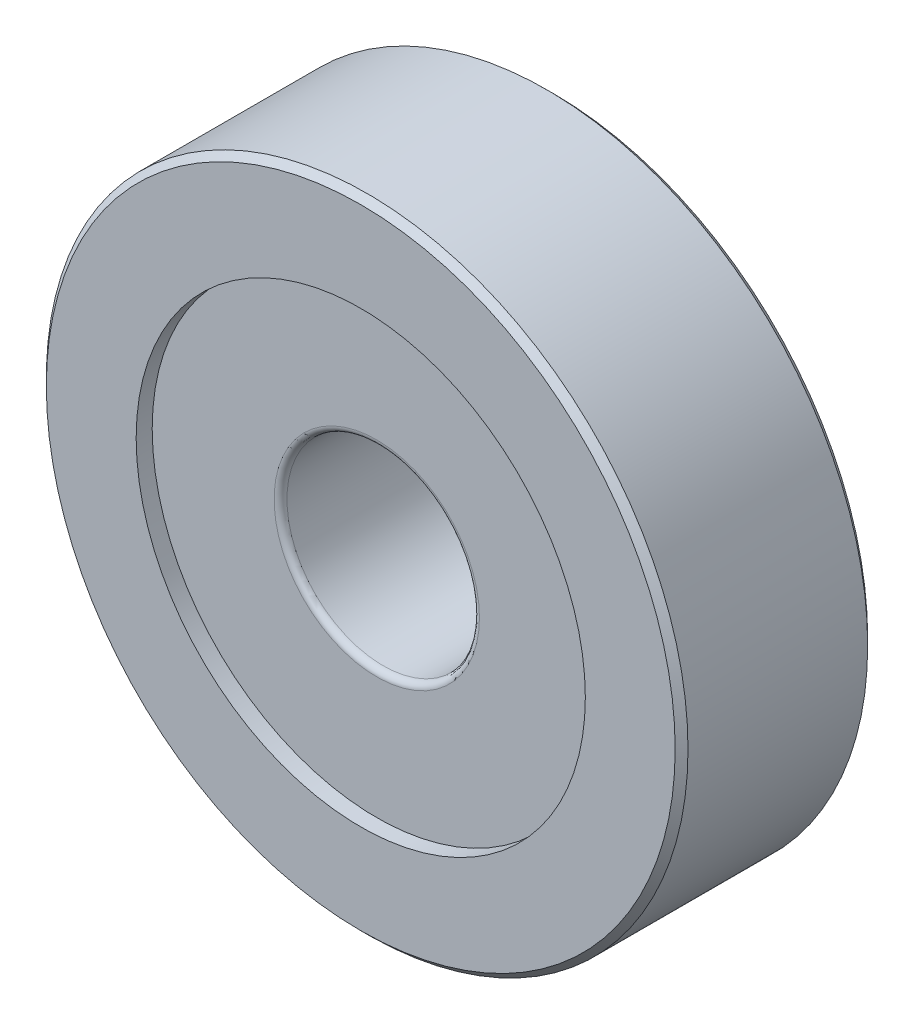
ISO-10303-21;
HEADER;
FILE_DESCRIPTION(('STEP AP214'),'2;1');
FILE_NAME('part.step','',(''),(''),'','','');
FILE_SCHEMA(('AUTOMOTIVE_DESIGN { 1 0 10303 214 1 1 1 1 }'));
ENDSEC;
DATA;
#1=APPLICATION_CONTEXT('core data for automotive mechanical design processes');
#2=APPLICATION_PROTOCOL_DEFINITION('international standard','automotive_design',2000,#1);
#3=PRODUCT_CONTEXT('',#1,'mechanical');
#4=PRODUCT('Part','Part','',(#3));
#5=PRODUCT_RELATED_PRODUCT_CATEGORY('part','',(#4));
#6=PRODUCT_DEFINITION_FORMATION('','',#4);
#7=PRODUCT_DEFINITION_CONTEXT('part definition',#1,'design');
#8=PRODUCT_DEFINITION('design','',#6,#7);
#9=PRODUCT_DEFINITION_SHAPE('','',#8);
#10=(LENGTH_UNIT() NAMED_UNIT(*) SI_UNIT(.MILLI.,.METRE.));
#11=(NAMED_UNIT(*) PLANE_ANGLE_UNIT() SI_UNIT($,.RADIAN.));
#12=(NAMED_UNIT(*) SI_UNIT($,.STERADIAN.) SOLID_ANGLE_UNIT());
#13=UNCERTAINTY_MEASURE_WITH_UNIT(LENGTH_MEASURE(1.E-05),#10,'distance_accuracy_value','');
#14=(GEOMETRIC_REPRESENTATION_CONTEXT(3) GLOBAL_UNCERTAINTY_ASSIGNED_CONTEXT((#13)) GLOBAL_UNIT_ASSIGNED_CONTEXT((#10,
#11,#12)) REPRESENTATION_CONTEXT('',''));
#15=CARTESIAN_POINT('',(0.,0.,0.));
#16=DIRECTION('',(0.,0.,1.));
#17=DIRECTION('',(1.,0.,0.));
#18=AXIS2_PLACEMENT_3D('',#15,#16,#17);
#19=CARTESIAN_POINT('',(0.,0.,2.30000000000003));
#20=DIRECTION('',(0.,0.,1.));
#21=DIRECTION('',(1.,0.,0.));
#22=AXIS2_PLACEMENT_3D('',#19,#20,#21);
#23=TOROIDAL_SURFACE('',#22,3.2,0.199999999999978);
#24=CARTESIAN_POINT('',(0.,0.,2.30000000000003));
#25=DIRECTION('',(0.,0.,1.));
#26=DIRECTION('',(1.,0.,0.));
#27=AXIS2_PLACEMENT_3D('',#24,#25,#26);
#28=CIRCLE('',#27,3.);
#29=CARTESIAN_POINT('',(3.,0.,2.30000000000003));
#30=VERTEX_POINT('',#29);
#31=EDGE_CURVE('E8',#30,#30,#28,.T.);
#32=ORIENTED_EDGE('',*,*,#31,.F.);
#33=EDGE_LOOP('',(#32));
#34=FACE_BOUND('',#33,.T.);
#35=CARTESIAN_POINT('',(0.,0.,2.5));
#36=DIRECTION('',(0.,0.,1.));
#37=DIRECTION('',(1.,0.,0.));
#38=AXIS2_PLACEMENT_3D('',#35,#36,#37);
#39=CIRCLE('',#38,3.2);
#40=CARTESIAN_POINT('',(3.2,0.,2.5));
#41=VERTEX_POINT('',#40);
#42=EDGE_CURVE('E52',#41,#41,#39,.T.);
#43=ORIENTED_EDGE('',*,*,#42,.T.);
#44=EDGE_LOOP('',(#43));
#45=FACE_BOUND('',#44,.T.);
#46=ADVANCED_FACE('F12',(#34,#45),#23,.T.);
#47=CARTESIAN_POINT('',(0.,0.,6.));
#48=DIRECTION('',(0.,0.,1.));
#49=DIRECTION('',(1.,0.,0.));
#50=AXIS2_PLACEMENT_3D('',#47,#48,#49);
#51=CYLINDRICAL_SURFACE('',#50,3.);
#52=CARTESIAN_POINT('',(0.,0.,-2.3));
#53=DIRECTION('',(0.,0.,1.));
#54=DIRECTION('',(1.,0.,0.));
#55=AXIS2_PLACEMENT_3D('',#52,#53,#54);
#56=CIRCLE('',#55,3.);
#57=CARTESIAN_POINT('',(3.,0.,-2.3));
#58=VERTEX_POINT('',#57);
#59=EDGE_CURVE('E18',#58,#58,#56,.T.);
#60=ORIENTED_EDGE('',*,*,#59,.F.);
#61=EDGE_LOOP('',(#60));
#62=FACE_BOUND('',#61,.T.);
#63=ORIENTED_EDGE('',*,*,#31,.T.);
#64=EDGE_LOOP('',(#63));
#65=FACE_BOUND('',#64,.T.);
#66=ADVANCED_FACE('F113',(#62,#65),#51,.F.);
#67=CARTESIAN_POINT('',(0.,0.,-2.3));
#68=DIRECTION('',(0.,0.,1.));
#69=DIRECTION('',(1.,0.,0.));
#70=AXIS2_PLACEMENT_3D('',#67,#68,#69);
#71=TOROIDAL_SURFACE('',#70,3.2,0.199999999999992);
#72=CARTESIAN_POINT('',(0.,0.,-2.5));
#73=DIRECTION('',(0.,0.,1.));
#74=DIRECTION('',(1.,0.,0.));
#75=AXIS2_PLACEMENT_3D('',#72,#73,#74);
#76=CIRCLE('',#75,3.2);
#77=CARTESIAN_POINT('',(3.2,0.,-2.5));
#78=VERTEX_POINT('',#77);
#79=EDGE_CURVE('E22',#78,#78,#76,.T.);
#80=ORIENTED_EDGE('',*,*,#79,.F.);
#81=EDGE_LOOP('',(#80));
#82=FACE_BOUND('',#81,.T.);
#83=ORIENTED_EDGE('',*,*,#59,.T.);
#84=EDGE_LOOP('',(#83));
#85=FACE_BOUND('',#84,.T.);
#86=ADVANCED_FACE('F108',(#82,#85),#71,.T.);
#87=CARTESIAN_POINT('',(0.,3.2,-2.5));
#88=DIRECTION('',(0.,0.,1.));
#89=DIRECTION('',(1.,0.,0.));
#90=AXIS2_PLACEMENT_3D('',#87,#88,#89);
#91=PLANE('',#90);
#92=CARTESIAN_POINT('',(0.,0.,-2.5));
#93=DIRECTION('',(0.,0.,1.));
#94=DIRECTION('',(1.,0.,0.));
#95=AXIS2_PLACEMENT_3D('',#92,#93,#94);
#96=CIRCLE('',#95,7.);
#97=CARTESIAN_POINT('',(7.,0.,-2.5));
#98=VERTEX_POINT('',#97);
#99=EDGE_CURVE('E26',#98,#98,#96,.T.);
#100=ORIENTED_EDGE('',*,*,#99,.F.);
#101=EDGE_LOOP('',(#100));
#102=FACE_BOUND('',#101,.T.);
#103=ORIENTED_EDGE('',*,*,#79,.T.);
#104=EDGE_LOOP('',(#103));
#105=FACE_BOUND('',#104,.T.);
#106=ADVANCED_FACE('F102',(#102,#105),#91,.F.);
#107=CARTESIAN_POINT('',(0.,0.,6.));
#108=DIRECTION('',(0.,0.,1.));
#109=DIRECTION('',(1.,0.,0.));
#110=AXIS2_PLACEMENT_3D('',#107,#108,#109);
#111=CYLINDRICAL_SURFACE('',#110,7.);
#112=CARTESIAN_POINT('',(0.,0.,-3.));
#113=DIRECTION('',(0.,0.,1.));
#114=DIRECTION('',(1.,0.,0.));
#115=AXIS2_PLACEMENT_3D('',#112,#113,#114);
#116=CIRCLE('',#115,7.);
#117=CARTESIAN_POINT('',(7.,0.,-3.));
#118=VERTEX_POINT('',#117);
#119=EDGE_CURVE('E31',#118,#118,#116,.T.);
#120=ORIENTED_EDGE('',*,*,#119,.F.);
#121=EDGE_LOOP('',(#120));
#122=FACE_BOUND('',#121,.T.);
#123=ORIENTED_EDGE('',*,*,#99,.T.);
#124=EDGE_LOOP('',(#123));
#125=FACE_BOUND('',#124,.T.);
#126=ADVANCED_FACE('F96',(#122,#125),#111,.F.);
#127=CARTESIAN_POINT('',(0.,9.8,-3.));
#128=DIRECTION('',(0.,0.,1.));
#129=DIRECTION('',(1.,0.,0.));
#130=AXIS2_PLACEMENT_3D('',#127,#128,#129);
#131=PLANE('',#130);
#132=CARTESIAN_POINT('',(0.,0.,-3.));
#133=DIRECTION('',(0.,0.,1.));
#134=DIRECTION('',(1.,0.,0.));
#135=AXIS2_PLACEMENT_3D('',#132,#133,#134);
#136=CIRCLE('',#135,9.8);
#137=CARTESIAN_POINT('',(9.8,0.,-3.));
#138=VERTEX_POINT('',#137);
#139=EDGE_CURVE('E34',#138,#138,#136,.T.);
#140=ORIENTED_EDGE('',*,*,#139,.F.);
#141=EDGE_LOOP('',(#140));
#142=FACE_BOUND('',#141,.T.);
#143=ORIENTED_EDGE('',*,*,#119,.T.);
#144=EDGE_LOOP('',(#143));
#145=FACE_BOUND('',#144,.T.);
#146=ADVANCED_FACE('F90',(#142,#145),#131,.F.);
#147=CARTESIAN_POINT('',(0.,0.,-3.));
#148=DIRECTION('',(0.,0.,1.));
#149=DIRECTION('',(1.,0.,0.));
#150=AXIS2_PLACEMENT_3D('',#147,#148,#149);
#151=CONICAL_SURFACE('',#150,9.8,0.785398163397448);
#152=CARTESIAN_POINT('',(0.,0.,-2.8));
#153=DIRECTION('',(0.,0.,1.));
#154=DIRECTION('',(1.,0.,0.));
#155=AXIS2_PLACEMENT_3D('',#152,#153,#154);
#156=CIRCLE('',#155,10.);
#157=CARTESIAN_POINT('',(10.,0.,-2.8));
#158=VERTEX_POINT('',#157);
#159=EDGE_CURVE('E37',#158,#158,#156,.T.);
#160=ORIENTED_EDGE('',*,*,#159,.F.);
#161=EDGE_LOOP('',(#160));
#162=FACE_BOUND('',#161,.T.);
#163=ORIENTED_EDGE('',*,*,#139,.T.);
#164=EDGE_LOOP('',(#163));
#165=FACE_BOUND('',#164,.T.);
#166=ADVANCED_FACE('F84',(#162,#165),#151,.T.);
#167=CARTESIAN_POINT('',(0.,0.,6.));
#168=DIRECTION('',(0.,0.,1.));
#169=DIRECTION('',(1.,0.,0.));
#170=AXIS2_PLACEMENT_3D('',#167,#168,#169);
#171=CYLINDRICAL_SURFACE('',#170,10.);
#172=CARTESIAN_POINT('',(0.,0.,2.8));
#173=DIRECTION('',(0.,0.,1.));
#174=DIRECTION('',(1.,0.,0.));
#175=AXIS2_PLACEMENT_3D('',#172,#173,#174);
#176=CIRCLE('',#175,10.);
#177=CARTESIAN_POINT('',(10.,0.,2.8));
#178=VERTEX_POINT('',#177);
#179=EDGE_CURVE('E40',#178,#178,#176,.T.);
#180=ORIENTED_EDGE('',*,*,#179,.F.);
#181=EDGE_LOOP('',(#180));
#182=FACE_BOUND('',#181,.T.);
#183=ORIENTED_EDGE('',*,*,#159,.T.);
#184=EDGE_LOOP('',(#183));
#185=FACE_BOUND('',#184,.T.);
#186=ADVANCED_FACE('F78',(#182,#185),#171,.T.);
#187=CARTESIAN_POINT('',(0.,0.,2.8));
#188=DIRECTION('',(0.,0.,-1.));
#189=DIRECTION('',(-1.,0.,0.));
#190=AXIS2_PLACEMENT_3D('',#187,#188,#189);
#191=CONICAL_SURFACE('',#190,10.,0.785398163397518);
#192=CARTESIAN_POINT('',(0.,0.,3.));
#193=DIRECTION('',(0.,0.,1.));
#194=DIRECTION('',(1.,0.,0.));
#195=AXIS2_PLACEMENT_3D('',#192,#193,#194);
#196=CIRCLE('',#195,9.8);
#197=CARTESIAN_POINT('',(9.8,0.,3.));
#198=VERTEX_POINT('',#197);
#199=EDGE_CURVE('E43',#198,#198,#196,.T.);
#200=ORIENTED_EDGE('',*,*,#199,.F.);
#201=EDGE_LOOP('',(#200));
#202=FACE_BOUND('',#201,.T.);
#203=ORIENTED_EDGE('',*,*,#179,.T.);
#204=EDGE_LOOP('',(#203));
#205=FACE_BOUND('',#204,.T.);
#206=ADVANCED_FACE('F72',(#202,#205),#191,.T.);
#207=CARTESIAN_POINT('',(0.,9.8,3.));
#208=DIRECTION('',(0.,0.,-1.));
#209=DIRECTION('',(-1.,0.,0.));
#210=AXIS2_PLACEMENT_3D('',#207,#208,#209);
#211=PLANE('',#210);
#212=CARTESIAN_POINT('',(0.,0.,3.));
#213=DIRECTION('',(0.,0.,1.));
#214=DIRECTION('',(1.,0.,0.));
#215=AXIS2_PLACEMENT_3D('',#212,#213,#214);
#216=CIRCLE('',#215,7.);
#217=CARTESIAN_POINT('',(7.,0.,3.));
#218=VERTEX_POINT('',#217);
#219=EDGE_CURVE('E46',#218,#218,#216,.T.);
#220=ORIENTED_EDGE('',*,*,#219,.F.);
#221=EDGE_LOOP('',(#220));
#222=FACE_BOUND('',#221,.T.);
#223=ORIENTED_EDGE('',*,*,#199,.T.);
#224=EDGE_LOOP('',(#223));
#225=FACE_BOUND('',#224,.T.);
#226=ADVANCED_FACE('F66',(#222,#225),#211,.F.);
#227=CARTESIAN_POINT('',(0.,0.,6.));
#228=DIRECTION('',(0.,0.,1.));
#229=DIRECTION('',(1.,0.,0.));
#230=AXIS2_PLACEMENT_3D('',#227,#228,#229);
#231=CYLINDRICAL_SURFACE('',#230,7.);
#232=CARTESIAN_POINT('',(0.,0.,2.5));
#233=DIRECTION('',(0.,0.,1.));
#234=DIRECTION('',(1.,0.,0.));
#235=AXIS2_PLACEMENT_3D('',#232,#233,#234);
#236=CIRCLE('',#235,7.);
#237=CARTESIAN_POINT('',(7.,0.,2.5));
#238=VERTEX_POINT('',#237);
#239=EDGE_CURVE('E49',#238,#238,#236,.T.);
#240=ORIENTED_EDGE('',*,*,#239,.F.);
#241=EDGE_LOOP('',(#240));
#242=FACE_BOUND('',#241,.T.);
#243=ORIENTED_EDGE('',*,*,#219,.T.);
#244=EDGE_LOOP('',(#243));
#245=FACE_BOUND('',#244,.T.);
#246=ADVANCED_FACE('F60',(#242,#245),#231,.F.);
#247=CARTESIAN_POINT('',(0.,3.2,2.5));
#248=DIRECTION('',(0.,0.,-1.));
#249=DIRECTION('',(-1.,0.,0.));
#250=AXIS2_PLACEMENT_3D('',#247,#248,#249);
#251=PLANE('',#250);
#252=ORIENTED_EDGE('',*,*,#42,.F.);
#253=EDGE_LOOP('',(#252));
#254=FACE_BOUND('',#253,.T.);
#255=ORIENTED_EDGE('',*,*,#239,.T.);
#256=EDGE_LOOP('',(#255));
#257=FACE_BOUND('',#256,.T.);
#258=ADVANCED_FACE('F57',(#254,#257),#251,.F.);
#259=CLOSED_SHELL('',(#46,#66,#86,#106,#126,#146,#166,#186,#206,#226,#246,#258));
#260=MANIFOLD_SOLID_BREP('B1',#259);
#261=ADVANCED_BREP_SHAPE_REPRESENTATION('',(#18,#260),#14);
#262=SHAPE_DEFINITION_REPRESENTATION(#9,#261);
ENDSEC;
END-ISO-10303-21;
